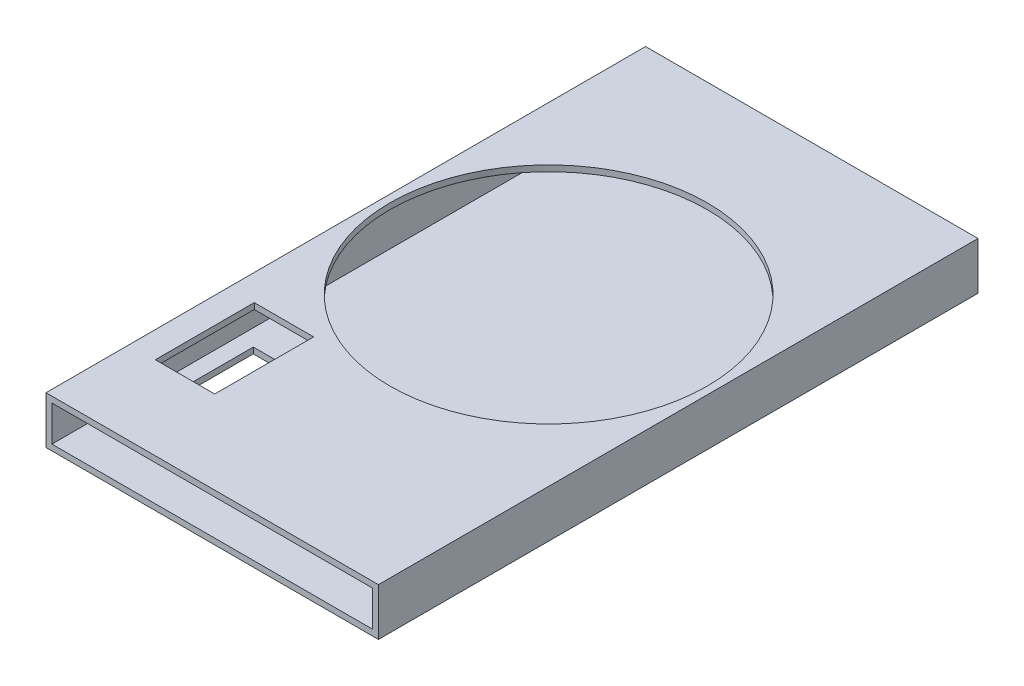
from build123d import *

# Parameters (mm, degrees)
SKETCH1_W               = 168
SKETCH1_H               = 24
SKETCH1_W_2             = 162
SKETCH1_H_2             = 18
BOSS_EXTRUDE1_DEPTH     = 300
SKETCH2_W               = 168
SKETCH2_H               = 24
BOSS_EXTRUDE2_DEPTH     = 3
SKETCH4_R               = 80.2
CUT_EXTRUDE1_DEPTH      = 3
CUT_EXTRUDE3_DEPTH      = 313.461197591
CUT_EXTRUDE3_DEPTH_BACK = 5
SKETCH8_W               = 33.6
SKETCH8_H               = 66
SKETCH9_W               = 30
SKETCH9_H               = 50
CUT_EXTRUDE4_DEPTH      = 5


with BuildPart() as part:
    # Sketch1 → Boss-Extrude1 (new body)
    with BuildSketch(Plane.XY):
        Rectangle(SKETCH1_W, SKETCH1_H)
        Rectangle(SKETCH1_W_2, SKETCH1_H_2, mode=Mode.SUBTRACT)
    extrude(amount=BOSS_EXTRUDE1_DEPTH)

    # Sketch2 → Boss-Extrude2 (add)
    with BuildSketch(Plane(origin=(0, 0, 0), x_dir=(-1, 0, 0), z_dir=(0, 0, -1))):
        Rectangle(SKETCH2_W, SKETCH2_H)
    extrude(amount=BOSS_EXTRUDE2_DEPTH)

    # Sketch4 → Cut-Extrude1 (cut)
    with BuildSketch(Plane(origin=(0, 12, 0), x_dir=(1, 0, 0), z_dir=(0, 1, 0))):
        with Locations(Location((0, -130, 0), (0, 0, 270))):
            Circle(SKETCH4_R)
    extrude(amount=-CUT_EXTRUDE1_DEPTH, mode=Mode.SUBTRACT)

    # Sketch8 → Cut-Extrude3 (cut, two sides: drawn at the far end of the back side and taken through both)
    with BuildSketch(Plane.XZ.offset(12).offset(-CUT_EXTRUDE3_DEPTH_BACK)):
        with Locations((-55.8, 239.652922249)):
            Rectangle(SKETCH8_W, SKETCH8_H)
    extrude(amount=CUT_EXTRUDE3_DEPTH + CUT_EXTRUDE3_DEPTH_BACK, mode=Mode.SUBTRACT)

    # Sketch9 → Cut-Extrude4 (cut)
    with BuildSketch(Plane(origin=(0, 12, 0), x_dir=(1, 0, 0), z_dir=(0, 1, 0))):
        with Locations((-55.8, -232.954991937)):
            Rectangle(SKETCH9_W, SKETCH9_H)
    extrude(amount=-CUT_EXTRUDE4_DEPTH, mode=Mode.SUBTRACT)


solid = part.part
